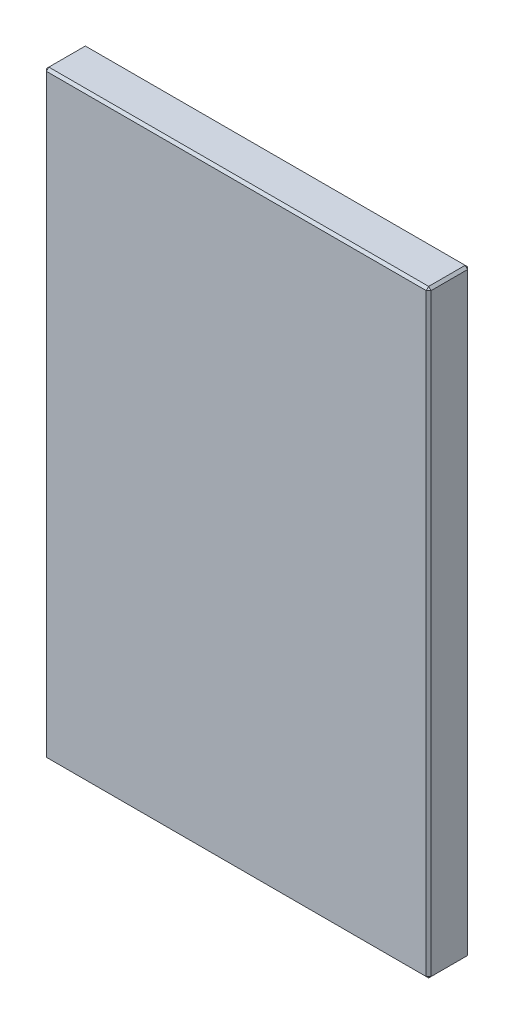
ISO-10303-21;
HEADER;
FILE_DESCRIPTION(('STEP AP214'),'2;1');
FILE_NAME('part.step','',(''),(''),'','','');
FILE_SCHEMA(('AUTOMOTIVE_DESIGN { 1 0 10303 214 1 1 1 1 }'));
ENDSEC;
DATA;
#1=APPLICATION_CONTEXT('core data for automotive mechanical design processes');
#2=APPLICATION_PROTOCOL_DEFINITION('international standard','automotive_design',2000,#1);
#3=PRODUCT_CONTEXT('',#1,'mechanical');
#4=PRODUCT('Part','Part','',(#3));
#5=PRODUCT_RELATED_PRODUCT_CATEGORY('part','',(#4));
#6=PRODUCT_DEFINITION_FORMATION('','',#4);
#7=PRODUCT_DEFINITION_CONTEXT('part definition',#1,'design');
#8=PRODUCT_DEFINITION('design','',#6,#7);
#9=PRODUCT_DEFINITION_SHAPE('','',#8);
#10=(LENGTH_UNIT() NAMED_UNIT(*) SI_UNIT(.MILLI.,.METRE.));
#11=(NAMED_UNIT(*) PLANE_ANGLE_UNIT() SI_UNIT($,.RADIAN.));
#12=(NAMED_UNIT(*) SI_UNIT($,.STERADIAN.) SOLID_ANGLE_UNIT());
#13=UNCERTAINTY_MEASURE_WITH_UNIT(LENGTH_MEASURE(1.E-05),#10,'distance_accuracy_value','');
#14=(GEOMETRIC_REPRESENTATION_CONTEXT(3) GLOBAL_UNCERTAINTY_ASSIGNED_CONTEXT((#13)) GLOBAL_UNIT_ASSIGNED_CONTEXT((#10,
#11,#12)) REPRESENTATION_CONTEXT('',''));
#15=CARTESIAN_POINT('',(0.,0.,0.));
#16=DIRECTION('',(0.,0.,1.));
#17=DIRECTION('',(1.,0.,0.));
#18=AXIS2_PLACEMENT_3D('',#15,#16,#17);
#19=CARTESIAN_POINT('',(-79.,-123.,17.));
#20=DIRECTION('',(1.,0.,0.));
#21=DIRECTION('',(0.,0.,-1.));
#22=AXIS2_PLACEMENT_3D('',#19,#20,#21);
#23=PLANE('',#22);
#24=DIRECTION('',(0.,0.,-1.));
#25=VECTOR('',#24,1.);
#26=CARTESIAN_POINT('',(-79.,122.,17.));
#27=LINE('',#26,#25);
#28=CARTESIAN_POINT('',(-79.,122.,16.));
#29=VERTEX_POINT('',#28);
#30=CARTESIAN_POINT('',(-79.,122.,1.00000000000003));
#31=VERTEX_POINT('',#30);
#32=EDGE_CURVE('E114',#29,#31,#27,.T.);
#33=ORIENTED_EDGE('',*,*,#32,.T.);
#34=DIRECTION('',(0.,-1.,0.));
#35=VECTOR('',#34,1.);
#36=CARTESIAN_POINT('',(-79.,-123.,1.00000000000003));
#37=LINE('',#36,#35);
#38=CARTESIAN_POINT('',(-79.,-122.,1.00000000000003));
#39=VERTEX_POINT('',#38);
#40=EDGE_CURVE('E110',#31,#39,#37,.T.);
#41=ORIENTED_EDGE('',*,*,#40,.T.);
#42=DIRECTION('',(0.,0.,1.));
#43=VECTOR('',#42,1.);
#44=CARTESIAN_POINT('',(-79.,-122.,17.));
#45=LINE('',#44,#43);
#46=CARTESIAN_POINT('',(-79.,-122.,16.));
#47=VERTEX_POINT('',#46);
#48=EDGE_CURVE('E103',#39,#47,#45,.T.);
#49=ORIENTED_EDGE('',*,*,#48,.T.);
#50=DIRECTION('',(0.,1.,0.));
#51=VECTOR('',#50,1.);
#52=CARTESIAN_POINT('',(-79.,123.,16.));
#53=LINE('',#52,#51);
#54=EDGE_CURVE('E107',#47,#29,#53,.T.);
#55=ORIENTED_EDGE('',*,*,#54,.T.);
#56=EDGE_LOOP('',(#33,#41,#49,#55));
#57=FACE_BOUND('',#56,.T.);
#58=ADVANCED_FACE('F15',(#57),#23,.F.);
#59=CARTESIAN_POINT('',(79.,-123.,17.));
#60=DIRECTION('',(0.,1.,0.));
#61=DIRECTION('',(0.,0.,1.));
#62=AXIS2_PLACEMENT_3D('',#59,#60,#61);
#63=PLANE('',#62);
#64=DIRECTION('',(0.,0.,-1.));
#65=VECTOR('',#64,1.);
#66=CARTESIAN_POINT('',(-78.,-123.,17.));
#67=LINE('',#66,#65);
#68=CARTESIAN_POINT('',(-78.,-123.,16.));
#69=VERTEX_POINT('',#68);
#70=CARTESIAN_POINT('',(-78.,-123.,1.00000000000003));
#71=VERTEX_POINT('',#70);
#72=EDGE_CURVE('E122',#69,#71,#67,.T.);
#73=ORIENTED_EDGE('',*,*,#72,.T.);
#74=DIRECTION('',(1.,0.,0.));
#75=VECTOR('',#74,1.);
#76=CARTESIAN_POINT('',(79.,-123.,1.00000000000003));
#77=LINE('',#76,#75);
#78=CARTESIAN_POINT('',(78.,-123.,1.00000000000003));
#79=VERTEX_POINT('',#78);
#80=EDGE_CURVE('E160',#71,#79,#77,.T.);
#81=ORIENTED_EDGE('',*,*,#80,.T.);
#82=DIRECTION('',(0.,0.,1.));
#83=VECTOR('',#82,1.);
#84=CARTESIAN_POINT('',(78.,-123.,17.));
#85=LINE('',#84,#83);
#86=CARTESIAN_POINT('',(78.,-123.,16.));
#87=VERTEX_POINT('',#86);
#88=EDGE_CURVE('E157',#79,#87,#85,.T.);
#89=ORIENTED_EDGE('',*,*,#88,.T.);
#90=DIRECTION('',(-1.,0.,0.));
#91=VECTOR('',#90,1.);
#92=CARTESIAN_POINT('',(-79.,-123.,16.));
#93=LINE('',#92,#91);
#94=EDGE_CURVE('E155',#87,#69,#93,.T.);
#95=ORIENTED_EDGE('',*,*,#94,.T.);
#96=EDGE_LOOP('',(#73,#81,#89,#95));
#97=FACE_BOUND('',#96,.T.);
#98=ADVANCED_FACE('F277',(#97),#63,.F.);
#99=CARTESIAN_POINT('',(79.,-123.,17.));
#100=DIRECTION('',(-1.,0.,0.));
#101=DIRECTION('',(0.,0.,1.));
#102=AXIS2_PLACEMENT_3D('',#99,#100,#101);
#103=PLANE('',#102);
#104=DIRECTION('',(0.,-1.,0.));
#105=VECTOR('',#104,1.);
#106=CARTESIAN_POINT('',(79.,-123.,16.));
#107=LINE('',#106,#105);
#108=CARTESIAN_POINT('',(79.,122.,16.));
#109=VERTEX_POINT('',#108);
#110=CARTESIAN_POINT('',(79.,-122.,16.));
#111=VERTEX_POINT('',#110);
#112=EDGE_CURVE('E162',#109,#111,#107,.T.);
#113=ORIENTED_EDGE('',*,*,#112,.T.);
#114=DIRECTION('',(0.,0.,-1.));
#115=VECTOR('',#114,1.);
#116=CARTESIAN_POINT('',(79.,-122.,17.));
#117=LINE('',#116,#115);
#118=CARTESIAN_POINT('',(79.,-122.,1.00000000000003));
#119=VERTEX_POINT('',#118);
#120=EDGE_CURVE('E168',#111,#119,#117,.T.);
#121=ORIENTED_EDGE('',*,*,#120,.T.);
#122=DIRECTION('',(0.,1.,0.));
#123=VECTOR('',#122,1.);
#124=CARTESIAN_POINT('',(79.,-123.,1.00000000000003));
#125=LINE('',#124,#123);
#126=CARTESIAN_POINT('',(79.,122.,1.00000000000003));
#127=VERTEX_POINT('',#126);
#128=EDGE_CURVE('E166',#119,#127,#125,.T.);
#129=ORIENTED_EDGE('',*,*,#128,.T.);
#130=DIRECTION('',(0.,0.,1.));
#131=VECTOR('',#130,1.);
#132=CARTESIAN_POINT('',(79.,122.,17.));
#133=LINE('',#132,#131);
#134=EDGE_CURVE('E164',#127,#109,#133,.T.);
#135=ORIENTED_EDGE('',*,*,#134,.T.);
#136=EDGE_LOOP('',(#113,#121,#129,#135));
#137=FACE_BOUND('',#136,.T.);
#138=ADVANCED_FACE('F254',(#137),#103,.F.);
#139=CARTESIAN_POINT('',(79.,123.,17.));
#140=DIRECTION('',(0.,-1.,0.));
#141=DIRECTION('',(1.,0.,0.));
#142=AXIS2_PLACEMENT_3D('',#139,#140,#141);
#143=PLANE('',#142);
#144=DIRECTION('',(-1.,0.,0.));
#145=VECTOR('',#144,1.);
#146=CARTESIAN_POINT('',(79.,123.,1.00000000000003));
#147=LINE('',#146,#145);
#148=CARTESIAN_POINT('',(78.,123.,1.00000000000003));
#149=VERTEX_POINT('',#148);
#150=CARTESIAN_POINT('',(-78.,123.,1.00000000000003));
#151=VERTEX_POINT('',#150);
#152=EDGE_CURVE('E150',#149,#151,#147,.T.);
#153=ORIENTED_EDGE('',*,*,#152,.T.);
#154=DIRECTION('',(0.,0.,1.));
#155=VECTOR('',#154,1.);
#156=CARTESIAN_POINT('',(-78.,123.,17.));
#157=LINE('',#156,#155);
#158=CARTESIAN_POINT('',(-78.,123.,16.));
#159=VERTEX_POINT('',#158);
#160=EDGE_CURVE('E152',#151,#159,#157,.T.);
#161=ORIENTED_EDGE('',*,*,#160,.T.);
#162=DIRECTION('',(1.,0.,0.));
#163=VECTOR('',#162,1.);
#164=CARTESIAN_POINT('',(79.,123.,16.));
#165=LINE('',#164,#163);
#166=CARTESIAN_POINT('',(78.,123.,16.));
#167=VERTEX_POINT('',#166);
#168=EDGE_CURVE('E146',#159,#167,#165,.T.);
#169=ORIENTED_EDGE('',*,*,#168,.T.);
#170=DIRECTION('',(0.,0.,-1.));
#171=VECTOR('',#170,1.);
#172=CARTESIAN_POINT('',(78.,123.,17.));
#173=LINE('',#172,#171);
#174=EDGE_CURVE('E148',#167,#149,#173,.T.);
#175=ORIENTED_EDGE('',*,*,#174,.T.);
#176=EDGE_LOOP('',(#153,#161,#169,#175));
#177=FACE_BOUND('',#176,.T.);
#178=ADVANCED_FACE('F286',(#177),#143,.F.);
#179=CARTESIAN_POINT('',(0.,0.,17.));
#180=DIRECTION('',(0.,0.,1.));
#181=DIRECTION('',(1.,0.,0.));
#182=AXIS2_PLACEMENT_3D('',#179,#180,#181);
#183=PLANE('',#182);
#184=DIRECTION('',(0.,1.,0.));
#185=VECTOR('',#184,1.);
#186=CARTESIAN_POINT('',(78.,123.,17.));
#187=LINE('',#186,#185);
#188=CARTESIAN_POINT('',(78.,-122.,17.));
#189=VERTEX_POINT('',#188);
#190=CARTESIAN_POINT('',(78.,122.,17.));
#191=VERTEX_POINT('',#190);
#192=EDGE_CURVE('E24',#189,#191,#187,.T.);
#193=ORIENTED_EDGE('',*,*,#192,.T.);
#194=DIRECTION('',(-1.,0.,0.));
#195=VECTOR('',#194,1.);
#196=CARTESIAN_POINT('',(-79.,122.,17.));
#197=LINE('',#196,#195);
#198=CARTESIAN_POINT('',(-78.,122.,17.));
#199=VERTEX_POINT('',#198);
#200=EDGE_CURVE('E9',#191,#199,#197,.T.);
#201=ORIENTED_EDGE('',*,*,#200,.T.);
#202=DIRECTION('',(0.,-1.,0.));
#203=VECTOR('',#202,1.);
#204=CARTESIAN_POINT('',(-78.,-123.,17.));
#205=LINE('',#204,#203);
#206=CARTESIAN_POINT('',(-78.,-122.,17.));
#207=VERTEX_POINT('',#206);
#208=EDGE_CURVE('E180',#199,#207,#205,.T.);
#209=ORIENTED_EDGE('',*,*,#208,.T.);
#210=DIRECTION('',(1.,0.,0.));
#211=VECTOR('',#210,1.);
#212=CARTESIAN_POINT('',(79.,-122.,17.));
#213=LINE('',#212,#211);
#214=EDGE_CURVE('E35',#207,#189,#213,.T.);
#215=ORIENTED_EDGE('',*,*,#214,.T.);
#216=EDGE_LOOP('',(#193,#201,#209,#215));
#217=FACE_BOUND('',#216,.T.);
#218=ADVANCED_FACE('F351',(#217),#183,.T.);
#219=CARTESIAN_POINT('',(0.,0.,0.));
#220=DIRECTION('',(0.,0.,1.));
#221=DIRECTION('',(1.,0.,0.));
#222=AXIS2_PLACEMENT_3D('',#219,#220,#221);
#223=PLANE('',#222);
#224=DIRECTION('',(0.,-1.,0.));
#225=VECTOR('',#224,1.);
#226=CARTESIAN_POINT('',(78.,0.,0.));
#227=LINE('',#226,#225);
#228=CARTESIAN_POINT('',(78.,122.,0.));
#229=VERTEX_POINT('',#228);
#230=CARTESIAN_POINT('',(78.,-122.,0.));
#231=VERTEX_POINT('',#230);
#232=EDGE_CURVE('E175',#229,#231,#227,.T.);
#233=ORIENTED_EDGE('',*,*,#232,.T.);
#234=DIRECTION('',(-1.,0.,0.));
#235=VECTOR('',#234,1.);
#236=CARTESIAN_POINT('',(0.,-122.,0.));
#237=LINE('',#236,#235);
#238=CARTESIAN_POINT('',(-78.,-122.,0.));
#239=VERTEX_POINT('',#238);
#240=EDGE_CURVE('E177',#231,#239,#237,.T.);
#241=ORIENTED_EDGE('',*,*,#240,.T.);
#242=DIRECTION('',(0.,1.,0.));
#243=VECTOR('',#242,1.);
#244=CARTESIAN_POINT('',(-78.,0.,0.));
#245=LINE('',#244,#243);
#246=CARTESIAN_POINT('',(-78.,122.,0.));
#247=VERTEX_POINT('',#246);
#248=EDGE_CURVE('E173',#239,#247,#245,.T.);
#249=ORIENTED_EDGE('',*,*,#248,.T.);
#250=DIRECTION('',(1.,0.,0.));
#251=VECTOR('',#250,1.);
#252=CARTESIAN_POINT('',(0.,122.,0.));
#253=LINE('',#252,#251);
#254=EDGE_CURVE('E171',#247,#229,#253,.T.);
#255=ORIENTED_EDGE('',*,*,#254,.T.);
#256=EDGE_LOOP('',(#233,#241,#249,#255));
#257=FACE_BOUND('',#256,.T.);
#258=ADVANCED_FACE('F246',(#257),#223,.F.);
#259=CARTESIAN_POINT('',(79.,-122.,17.));
#260=DIRECTION('',(-0.707106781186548,0.707106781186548,0.));
#261=DIRECTION('',(0.,0.,-1.));
#262=AXIS2_PLACEMENT_3D('',#259,#260,#261);
#263=PLANE('',#262);
#264=DIRECTION('',(-0.707106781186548,-0.707106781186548,0.));
#265=VECTOR('',#264,1.);
#266=CARTESIAN_POINT('',(78.,-123.,16.));
#267=LINE('',#266,#265);
#268=EDGE_CURVE('E19',#87,#111,#267,.F.);
#269=ORIENTED_EDGE('',*,*,#268,.F.);
#270=ORIENTED_EDGE('',*,*,#88,.F.);
#271=DIRECTION('',(0.707106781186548,0.707106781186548,0.));
#272=VECTOR('',#271,1.);
#273=CARTESIAN_POINT('',(79.,-122.,1.00000000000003));
#274=LINE('',#273,#272);
#275=EDGE_CURVE('E142',#119,#79,#274,.F.);
#276=ORIENTED_EDGE('',*,*,#275,.F.);
#277=ORIENTED_EDGE('',*,*,#120,.F.);
#278=EDGE_LOOP('',(#269,#270,#276,#277));
#279=FACE_BOUND('',#278,.T.);
#280=ADVANCED_FACE('F17',(#279),#263,.F.);
#281=CARTESIAN_POINT('',(78.,-123.,16.));
#282=DIRECTION('',(0.577350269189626,-0.577350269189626,0.577350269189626));
#283=DIRECTION('',(0.707106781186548,0.,-0.707106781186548));
#284=AXIS2_PLACEMENT_3D('',#281,#282,#283);
#285=PLANE('',#284);
#286=DIRECTION('',(0.,-0.707106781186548,-0.707106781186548));
#287=VECTOR('',#286,1.);
#288=CARTESIAN_POINT('',(78.,-123.,16.));
#289=LINE('',#288,#287);
#290=EDGE_CURVE('E227',#87,#189,#289,.F.);
#291=ORIENTED_EDGE('',*,*,#290,.F.);
#292=ORIENTED_EDGE('',*,*,#268,.T.);
#293=DIRECTION('',(-0.707106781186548,0.,0.707106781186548));
#294=VECTOR('',#293,1.);
#295=CARTESIAN_POINT('',(78.5,-122.,16.5));
#296=LINE('',#295,#294);
#297=EDGE_CURVE('E229',#189,#111,#296,.F.);
#298=ORIENTED_EDGE('',*,*,#297,.F.);
#299=EDGE_LOOP('',(#291,#292,#298));
#300=FACE_BOUND('',#299,.T.);
#301=ADVANCED_FACE('F272',(#300),#285,.T.);
#302=CARTESIAN_POINT('',(79.,-122.,1.00000000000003));
#303=DIRECTION('',(0.577350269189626,-0.577350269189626,-0.577350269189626));
#304=DIRECTION('',(-0.707106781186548,0.,-0.707106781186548));
#305=AXIS2_PLACEMENT_3D('',#302,#303,#304);
#306=PLANE('',#305);
#307=DIRECTION('',(-0.707106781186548,0.,-0.707106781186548));
#308=VECTOR('',#307,1.);
#309=CARTESIAN_POINT('',(79.,-122.,1.00000000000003));
#310=LINE('',#309,#308);
#311=EDGE_CURVE('E221',#119,#231,#310,.T.);
#312=ORIENTED_EDGE('',*,*,#311,.F.);
#313=ORIENTED_EDGE('',*,*,#275,.T.);
#314=DIRECTION('',(0.,-0.707106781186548,0.707106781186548));
#315=VECTOR('',#314,1.);
#316=CARTESIAN_POINT('',(78.,-122.5,0.500000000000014));
#317=LINE('',#316,#315);
#318=EDGE_CURVE('E224',#231,#79,#317,.T.);
#319=ORIENTED_EDGE('',*,*,#318,.F.);
#320=EDGE_LOOP('',(#312,#313,#319));
#321=FACE_BOUND('',#320,.T.);
#322=ADVANCED_FACE('F236',(#321),#306,.T.);
#323=CARTESIAN_POINT('',(78.,0.,17.));
#324=DIRECTION('',(0.707106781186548,0.,0.707106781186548));
#325=DIRECTION('',(0.,-1.,0.));
#326=AXIS2_PLACEMENT_3D('',#323,#324,#325);
#327=PLANE('',#326);
#328=ORIENTED_EDGE('',*,*,#297,.T.);
#329=ORIENTED_EDGE('',*,*,#112,.F.);
#330=DIRECTION('',(0.707106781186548,0.,-0.707106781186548));
#331=VECTOR('',#330,1.);
#332=CARTESIAN_POINT('',(79.,122.,16.));
#333=LINE('',#332,#331);
#334=EDGE_CURVE('E215',#191,#109,#333,.T.);
#335=ORIENTED_EDGE('',*,*,#334,.F.);
#336=ORIENTED_EDGE('',*,*,#192,.F.);
#337=EDGE_LOOP('',(#328,#329,#335,#336));
#338=FACE_BOUND('',#337,.T.);
#339=ADVANCED_FACE('F267',(#338),#327,.T.);
#340=CARTESIAN_POINT('',(0.,-122.,17.));
#341=DIRECTION('',(0.,-0.707106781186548,0.707106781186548));
#342=DIRECTION('',(-1.,0.,0.));
#343=AXIS2_PLACEMENT_3D('',#340,#341,#342);
#344=PLANE('',#343);
#345=ORIENTED_EDGE('',*,*,#290,.T.);
#346=ORIENTED_EDGE('',*,*,#214,.F.);
#347=DIRECTION('',(0.,0.707106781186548,0.707106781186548));
#348=VECTOR('',#347,1.);
#349=CARTESIAN_POINT('',(-78.,-122.5,16.5));
#350=LINE('',#349,#348);
#351=EDGE_CURVE('E126',#69,#207,#350,.T.);
#352=ORIENTED_EDGE('',*,*,#351,.F.);
#353=ORIENTED_EDGE('',*,*,#94,.F.);
#354=EDGE_LOOP('',(#345,#346,#352,#353));
#355=FACE_BOUND('',#354,.T.);
#356=ADVANCED_FACE('F275',(#355),#344,.T.);
#357=CARTESIAN_POINT('',(-78.,-123.,17.));
#358=DIRECTION('',(0.707106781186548,0.707106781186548,0.));
#359=DIRECTION('',(0.,0.,-1.));
#360=AXIS2_PLACEMENT_3D('',#357,#358,#359);
#361=PLANE('',#360);
#362=DIRECTION('',(0.707106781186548,-0.707106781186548,0.));
#363=VECTOR('',#362,1.);
#364=CARTESIAN_POINT('',(-78.,-123.,1.00000000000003));
#365=LINE('',#364,#363);
#366=EDGE_CURVE('E127',#71,#39,#365,.F.);
#367=ORIENTED_EDGE('',*,*,#366,.F.);
#368=ORIENTED_EDGE('',*,*,#72,.F.);
#369=DIRECTION('',(-0.707106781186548,0.707106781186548,0.));
#370=VECTOR('',#369,1.);
#371=CARTESIAN_POINT('',(-79.,-122.,16.));
#372=LINE('',#371,#370);
#373=EDGE_CURVE('E118',#47,#69,#372,.F.);
#374=ORIENTED_EDGE('',*,*,#373,.F.);
#375=ORIENTED_EDGE('',*,*,#48,.F.);
#376=EDGE_LOOP('',(#367,#368,#374,#375));
#377=FACE_BOUND('',#376,.T.);
#378=ADVANCED_FACE('F120',(#377),#361,.F.);
#379=CARTESIAN_POINT('',(79.,-123.,1.00000000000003));
#380=DIRECTION('',(0.,0.707106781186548,0.707106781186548));
#381=DIRECTION('',(1.,0.,0.));
#382=AXIS2_PLACEMENT_3D('',#379,#380,#381);
#383=PLANE('',#382);
#384=ORIENTED_EDGE('',*,*,#318,.T.);
#385=ORIENTED_EDGE('',*,*,#80,.F.);
#386=DIRECTION('',(0.,0.707106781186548,-0.707106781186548));
#387=VECTOR('',#386,1.);
#388=CARTESIAN_POINT('',(-78.,-123.,1.00000000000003));
#389=LINE('',#388,#387);
#390=EDGE_CURVE('E211',#239,#71,#389,.F.);
#391=ORIENTED_EDGE('',*,*,#390,.F.);
#392=ORIENTED_EDGE('',*,*,#240,.F.);
#393=EDGE_LOOP('',(#384,#385,#391,#392));
#394=FACE_BOUND('',#393,.T.);
#395=ADVANCED_FACE('F243',(#394),#383,.F.);
#396=CARTESIAN_POINT('',(79.,-123.,1.00000000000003));
#397=DIRECTION('',(-0.707106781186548,0.,0.707106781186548));
#398=DIRECTION('',(0.,1.,0.));
#399=AXIS2_PLACEMENT_3D('',#396,#397,#398);
#400=PLANE('',#399);
#401=ORIENTED_EDGE('',*,*,#311,.T.);
#402=ORIENTED_EDGE('',*,*,#232,.F.);
#403=DIRECTION('',(0.707106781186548,0.,0.707106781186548));
#404=VECTOR('',#403,1.);
#405=CARTESIAN_POINT('',(79.,122.,1.00000000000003));
#406=LINE('',#405,#404);
#407=EDGE_CURVE('E208',#127,#229,#406,.F.);
#408=ORIENTED_EDGE('',*,*,#407,.F.);
#409=ORIENTED_EDGE('',*,*,#128,.F.);
#410=EDGE_LOOP('',(#401,#402,#408,#409));
#411=FACE_BOUND('',#410,.T.);
#412=ADVANCED_FACE('F251',(#411),#400,.F.);
#413=CARTESIAN_POINT('',(78.,123.,17.));
#414=DIRECTION('',(-0.707106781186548,-0.707106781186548,0.));
#415=DIRECTION('',(0.,0.,-1.));
#416=AXIS2_PLACEMENT_3D('',#413,#414,#415);
#417=PLANE('',#416);
#418=DIRECTION('',(0.707106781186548,-0.707106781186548,0.));
#419=VECTOR('',#418,1.);
#420=CARTESIAN_POINT('',(79.,122.,16.));
#421=LINE('',#420,#419);
#422=EDGE_CURVE('E218',#109,#167,#421,.F.);
#423=ORIENTED_EDGE('',*,*,#422,.F.);
#424=ORIENTED_EDGE('',*,*,#134,.F.);
#425=DIRECTION('',(-0.707106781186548,0.707106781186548,0.));
#426=VECTOR('',#425,1.);
#427=CARTESIAN_POINT('',(79.,122.,1.00000000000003));
#428=LINE('',#427,#426);
#429=EDGE_CURVE('E205',#149,#127,#428,.F.);
#430=ORIENTED_EDGE('',*,*,#429,.F.);
#431=ORIENTED_EDGE('',*,*,#174,.F.);
#432=EDGE_LOOP('',(#423,#424,#430,#431));
#433=FACE_BOUND('',#432,.T.);
#434=ADVANCED_FACE('F259',(#433),#417,.F.);
#435=CARTESIAN_POINT('',(79.,122.,16.));
#436=DIRECTION('',(0.577350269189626,0.577350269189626,0.577350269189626));
#437=DIRECTION('',(0.707106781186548,0.,-0.707106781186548));
#438=AXIS2_PLACEMENT_3D('',#435,#436,#437);
#439=PLANE('',#438);
#440=ORIENTED_EDGE('',*,*,#334,.T.);
#441=ORIENTED_EDGE('',*,*,#422,.T.);
#442=DIRECTION('',(0.,-0.707106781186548,0.707106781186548));
#443=VECTOR('',#442,1.);
#444=CARTESIAN_POINT('',(78.,122.5,16.5));
#445=LINE('',#444,#443);
#446=EDGE_CURVE('E134',#191,#167,#445,.F.);
#447=ORIENTED_EDGE('',*,*,#446,.F.);
#448=EDGE_LOOP('',(#440,#441,#447));
#449=FACE_BOUND('',#448,.T.);
#450=ADVANCED_FACE('F264',(#449),#439,.T.);
#451=CARTESIAN_POINT('',(-79.,-122.,16.));
#452=DIRECTION('',(-0.577350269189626,-0.577350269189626,0.577350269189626));
#453=DIRECTION('',(0.707106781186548,0.,0.707106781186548));
#454=AXIS2_PLACEMENT_3D('',#451,#452,#453);
#455=PLANE('',#454);
#456=ORIENTED_EDGE('',*,*,#373,.T.);
#457=ORIENTED_EDGE('',*,*,#351,.T.);
#458=DIRECTION('',(-0.707106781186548,0.,-0.707106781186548));
#459=VECTOR('',#458,1.);
#460=CARTESIAN_POINT('',(-79.,-122.,16.));
#461=LINE('',#460,#459);
#462=EDGE_CURVE('E130',#47,#207,#461,.F.);
#463=ORIENTED_EDGE('',*,*,#462,.F.);
#464=EDGE_LOOP('',(#456,#457,#463));
#465=FACE_BOUND('',#464,.T.);
#466=ADVANCED_FACE('F131',(#465),#455,.T.);
#467=CARTESIAN_POINT('',(-78.,-123.,1.00000000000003));
#468=DIRECTION('',(-0.577350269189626,-0.577350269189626,-0.577350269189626));
#469=DIRECTION('',(-0.707106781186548,0.,0.707106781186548));
#470=AXIS2_PLACEMENT_3D('',#467,#468,#469);
#471=PLANE('',#470);
#472=ORIENTED_EDGE('',*,*,#390,.T.);
#473=ORIENTED_EDGE('',*,*,#366,.T.);
#474=DIRECTION('',(-0.707106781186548,0.,0.707106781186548));
#475=VECTOR('',#474,1.);
#476=CARTESIAN_POINT('',(-78.5,-122.,0.500000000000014));
#477=LINE('',#476,#475);
#478=EDGE_CURVE('E135',#239,#39,#477,.T.);
#479=ORIENTED_EDGE('',*,*,#478,.F.);
#480=EDGE_LOOP('',(#472,#473,#479));
#481=FACE_BOUND('',#480,.T.);
#482=ADVANCED_FACE('F320',(#481),#471,.T.);
#483=CARTESIAN_POINT('',(79.,122.,1.00000000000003));
#484=DIRECTION('',(0.577350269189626,0.577350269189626,-0.577350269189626));
#485=DIRECTION('',(-0.707106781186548,0.,-0.707106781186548));
#486=AXIS2_PLACEMENT_3D('',#483,#484,#485);
#487=PLANE('',#486);
#488=ORIENTED_EDGE('',*,*,#429,.T.);
#489=ORIENTED_EDGE('',*,*,#407,.T.);
#490=DIRECTION('',(0.,-0.707106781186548,-0.707106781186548));
#491=VECTOR('',#490,1.);
#492=CARTESIAN_POINT('',(78.,122.5,0.500000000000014));
#493=LINE('',#492,#491);
#494=EDGE_CURVE('E198',#149,#229,#493,.T.);
#495=ORIENTED_EDGE('',*,*,#494,.F.);
#496=EDGE_LOOP('',(#488,#489,#495));
#497=FACE_BOUND('',#496,.T.);
#498=ADVANCED_FACE('F316',(#497),#487,.T.);
#499=CARTESIAN_POINT('',(0.,122.,17.));
#500=DIRECTION('',(0.,0.707106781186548,0.707106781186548));
#501=DIRECTION('',(1.,0.,0.));
#502=AXIS2_PLACEMENT_3D('',#499,#500,#501);
#503=PLANE('',#502);
#504=ORIENTED_EDGE('',*,*,#446,.T.);
#505=ORIENTED_EDGE('',*,*,#168,.F.);
#506=DIRECTION('',(0.,0.707106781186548,-0.707106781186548));
#507=VECTOR('',#506,1.);
#508=CARTESIAN_POINT('',(-78.,123.,16.));
#509=LINE('',#508,#507);
#510=EDGE_CURVE('E195',#199,#159,#509,.T.);
#511=ORIENTED_EDGE('',*,*,#510,.F.);
#512=ORIENTED_EDGE('',*,*,#200,.F.);
#513=EDGE_LOOP('',(#504,#505,#511,#512));
#514=FACE_BOUND('',#513,.T.);
#515=ADVANCED_FACE('F313',(#514),#503,.T.);
#516=CARTESIAN_POINT('',(-78.,0.,17.));
#517=DIRECTION('',(-0.707106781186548,0.,0.707106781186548));
#518=DIRECTION('',(0.,1.,0.));
#519=AXIS2_PLACEMENT_3D('',#516,#517,#518);
#520=PLANE('',#519);
#521=ORIENTED_EDGE('',*,*,#462,.T.);
#522=ORIENTED_EDGE('',*,*,#208,.F.);
#523=DIRECTION('',(0.707106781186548,0.,0.707106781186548));
#524=VECTOR('',#523,1.);
#525=CARTESIAN_POINT('',(-78.5,122.,16.5));
#526=LINE('',#525,#524);
#527=EDGE_CURVE('E138',#29,#199,#526,.T.);
#528=ORIENTED_EDGE('',*,*,#527,.F.);
#529=ORIENTED_EDGE('',*,*,#54,.F.);
#530=EDGE_LOOP('',(#521,#522,#528,#529));
#531=FACE_BOUND('',#530,.T.);
#532=ADVANCED_FACE('F137',(#531),#520,.T.);
#533=CARTESIAN_POINT('',(-79.,-123.,1.00000000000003));
#534=DIRECTION('',(0.707106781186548,0.,0.707106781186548));
#535=DIRECTION('',(0.,-1.,0.));
#536=AXIS2_PLACEMENT_3D('',#533,#534,#535);
#537=PLANE('',#536);
#538=ORIENTED_EDGE('',*,*,#478,.T.);
#539=ORIENTED_EDGE('',*,*,#40,.F.);
#540=DIRECTION('',(0.707106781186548,0.,-0.707106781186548));
#541=VECTOR('',#540,1.);
#542=CARTESIAN_POINT('',(-79.,122.,1.00000000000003));
#543=LINE('',#542,#541);
#544=EDGE_CURVE('E191',#247,#31,#543,.F.);
#545=ORIENTED_EDGE('',*,*,#544,.F.);
#546=ORIENTED_EDGE('',*,*,#248,.F.);
#547=EDGE_LOOP('',(#538,#539,#545,#546));
#548=FACE_BOUND('',#547,.T.);
#549=ADVANCED_FACE('F306',(#548),#537,.F.);
#550=CARTESIAN_POINT('',(79.,123.,1.00000000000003));
#551=DIRECTION('',(0.,-0.707106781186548,0.707106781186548));
#552=DIRECTION('',(-1.,0.,0.));
#553=AXIS2_PLACEMENT_3D('',#550,#551,#552);
#554=PLANE('',#553);
#555=ORIENTED_EDGE('',*,*,#494,.T.);
#556=ORIENTED_EDGE('',*,*,#254,.F.);
#557=DIRECTION('',(0.,0.707106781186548,0.707106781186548));
#558=VECTOR('',#557,1.);
#559=CARTESIAN_POINT('',(-78.,122.5,0.500000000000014));
#560=LINE('',#559,#558);
#561=EDGE_CURVE('E188',#151,#247,#560,.F.);
#562=ORIENTED_EDGE('',*,*,#561,.F.);
#563=ORIENTED_EDGE('',*,*,#152,.F.);
#564=EDGE_LOOP('',(#555,#556,#562,#563));
#565=FACE_BOUND('',#564,.T.);
#566=ADVANCED_FACE('F302',(#565),#554,.F.);
#567=CARTESIAN_POINT('',(-78.,123.,16.));
#568=DIRECTION('',(-0.577350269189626,0.577350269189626,0.577350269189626));
#569=DIRECTION('',(0.707106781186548,0.,0.707106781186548));
#570=AXIS2_PLACEMENT_3D('',#567,#568,#569);
#571=PLANE('',#570);
#572=ORIENTED_EDGE('',*,*,#527,.T.);
#573=ORIENTED_EDGE('',*,*,#510,.T.);
#574=DIRECTION('',(0.707106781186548,0.707106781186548,0.));
#575=VECTOR('',#574,1.);
#576=CARTESIAN_POINT('',(-78.,123.,16.));
#577=LINE('',#576,#575);
#578=EDGE_CURVE('E186',#29,#159,#577,.T.);
#579=ORIENTED_EDGE('',*,*,#578,.F.);
#580=EDGE_LOOP('',(#572,#573,#579));
#581=FACE_BOUND('',#580,.T.);
#582=ADVANCED_FACE('F298',(#581),#571,.T.);
#583=CARTESIAN_POINT('',(-79.,122.,1.00000000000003));
#584=DIRECTION('',(-0.577350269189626,0.577350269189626,-0.577350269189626));
#585=DIRECTION('',(-0.707106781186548,0.,0.707106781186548));
#586=AXIS2_PLACEMENT_3D('',#583,#584,#585);
#587=PLANE('',#586);
#588=ORIENTED_EDGE('',*,*,#561,.T.);
#589=ORIENTED_EDGE('',*,*,#544,.T.);
#590=DIRECTION('',(-0.707106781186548,-0.707106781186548,0.));
#591=VECTOR('',#590,1.);
#592=CARTESIAN_POINT('',(-79.,122.,1.00000000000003));
#593=LINE('',#592,#591);
#594=EDGE_CURVE('E184',#151,#31,#593,.T.);
#595=ORIENTED_EDGE('',*,*,#594,.F.);
#596=EDGE_LOOP('',(#588,#589,#595));
#597=FACE_BOUND('',#596,.T.);
#598=ADVANCED_FACE('F294',(#597),#587,.T.);
#599=CARTESIAN_POINT('',(-79.,122.,17.));
#600=DIRECTION('',(0.707106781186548,-0.707106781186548,0.));
#601=DIRECTION('',(0.,0.,-1.));
#602=AXIS2_PLACEMENT_3D('',#599,#600,#601);
#603=PLANE('',#602);
#604=ORIENTED_EDGE('',*,*,#578,.T.);
#605=ORIENTED_EDGE('',*,*,#160,.F.);
#606=ORIENTED_EDGE('',*,*,#594,.T.);
#607=ORIENTED_EDGE('',*,*,#32,.F.);
#608=EDGE_LOOP('',(#604,#605,#606,#607));
#609=FACE_BOUND('',#608,.T.);
#610=ADVANCED_FACE('F291',(#609),#603,.F.);
#611=CLOSED_SHELL('',(#58,#98,#138,#178,#218,#258,#280,#301,#322,#339,#356,#378,#395,#412,#434,
#450,#466,#482,#498,#515,#532,#549,#566,#582,#598,#610));
#612=MANIFOLD_SOLID_BREP('B1',#611);
#613=ADVANCED_BREP_SHAPE_REPRESENTATION('',(#18,#612),#14);
#614=SHAPE_DEFINITION_REPRESENTATION(#9,#613);
ENDSEC;
END-ISO-10303-21;
